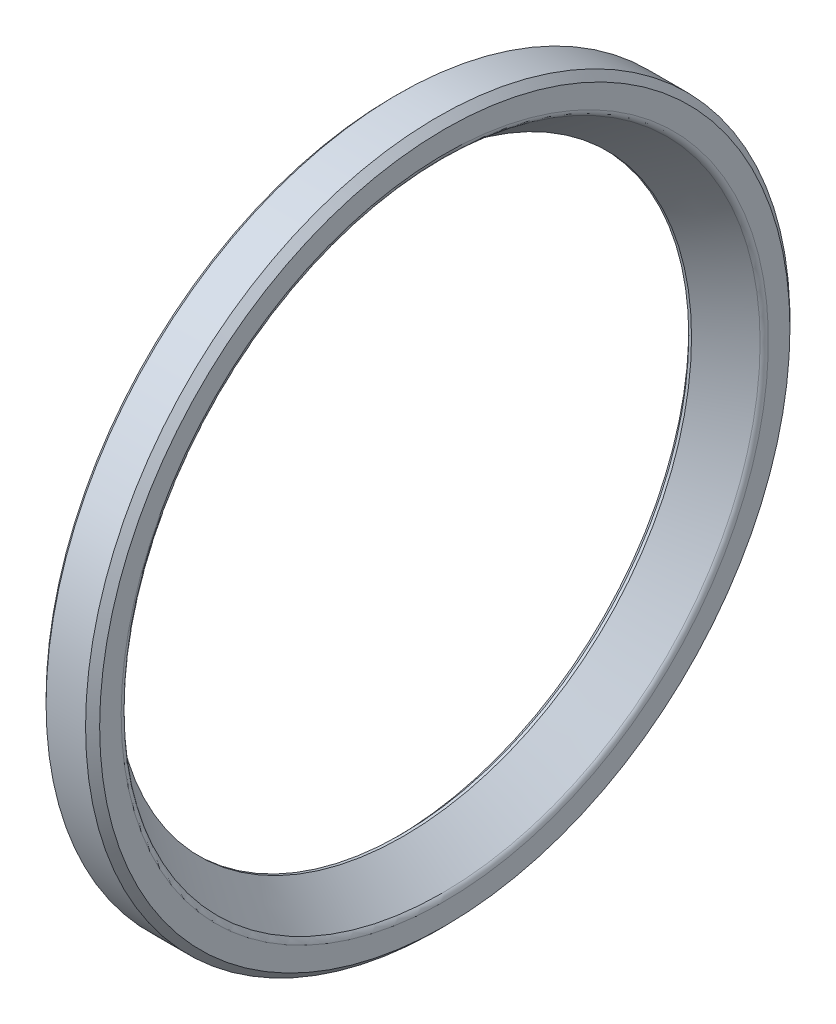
ISO-10303-21;
HEADER;
FILE_DESCRIPTION(('STEP AP214'),'2;1');
FILE_NAME('part.step','',(''),(''),'','','');
FILE_SCHEMA(('AUTOMOTIVE_DESIGN { 1 0 10303 214 1 1 1 1 }'));
ENDSEC;
DATA;
#1=APPLICATION_CONTEXT('core data for automotive mechanical design processes');
#2=APPLICATION_PROTOCOL_DEFINITION('international standard','automotive_design',2000,#1);
#3=PRODUCT_CONTEXT('',#1,'mechanical');
#4=PRODUCT('Part','Part','',(#3));
#5=PRODUCT_RELATED_PRODUCT_CATEGORY('part','',(#4));
#6=PRODUCT_DEFINITION_FORMATION('','',#4);
#7=PRODUCT_DEFINITION_CONTEXT('part definition',#1,'design');
#8=PRODUCT_DEFINITION('design','',#6,#7);
#9=PRODUCT_DEFINITION_SHAPE('','',#8);
#10=(LENGTH_UNIT() NAMED_UNIT(*) SI_UNIT(.MILLI.,.METRE.));
#11=(NAMED_UNIT(*) PLANE_ANGLE_UNIT() SI_UNIT($,.RADIAN.));
#12=(NAMED_UNIT(*) SI_UNIT($,.STERADIAN.) SOLID_ANGLE_UNIT());
#13=UNCERTAINTY_MEASURE_WITH_UNIT(LENGTH_MEASURE(1.E-05),#10,'distance_accuracy_value','');
#14=(GEOMETRIC_REPRESENTATION_CONTEXT(3) GLOBAL_UNCERTAINTY_ASSIGNED_CONTEXT((#13)) GLOBAL_UNIT_ASSIGNED_CONTEXT((#10,
#11,#12)) REPRESENTATION_CONTEXT('',''));
#15=CARTESIAN_POINT('',(0.,0.,0.));
#16=DIRECTION('',(0.,0.,1.));
#17=DIRECTION('',(1.,0.,0.));
#18=AXIS2_PLACEMENT_3D('',#15,#16,#17);
#19=CARTESIAN_POINT('',(0.73333333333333,0.,0.));
#20=DIRECTION('',(1.,0.,0.));
#21=DIRECTION('',(0.,0.,-1.));
#22=AXIS2_PLACEMENT_3D('',#19,#20,#21);
#23=CONICAL_SURFACE('',#22,55.,0.785398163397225);
#24=CARTESIAN_POINT('',(0.,0.,0.));
#25=DIRECTION('',(-1.,0.,0.));
#26=DIRECTION('',(0.,0.,1.));
#27=AXIS2_PLACEMENT_3D('',#24,#25,#26);
#28=CIRCLE('',#27,54.266666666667);
#29=CARTESIAN_POINT('',(0.,0.,54.266666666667));
#30=VERTEX_POINT('',#29);
#31=EDGE_CURVE('E87',#30,#30,#28,.T.);
#32=ORIENTED_EDGE('',*,*,#31,.F.);
#33=EDGE_LOOP('',(#32));
#34=FACE_BOUND('',#33,.T.);
#35=CARTESIAN_POINT('',(0.73333333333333,0.,0.));
#36=DIRECTION('',(-1.,0.,0.));
#37=DIRECTION('',(0.,0.,1.));
#38=AXIS2_PLACEMENT_3D('',#35,#36,#37);
#39=CIRCLE('',#38,55.);
#40=CARTESIAN_POINT('',(0.73333333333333,0.,55.));
#41=VERTEX_POINT('',#40);
#42=EDGE_CURVE('E10',#41,#41,#39,.T.);
#43=ORIENTED_EDGE('',*,*,#42,.T.);
#44=EDGE_LOOP('',(#43));
#45=FACE_BOUND('',#44,.T.);
#46=ADVANCED_FACE('F29',(#34,#45),#23,.T.);
#47=CARTESIAN_POINT('',(8.,0.,0.));
#48=DIRECTION('',(-1.,0.,0.));
#49=DIRECTION('',(0.,0.,1.));
#50=AXIS2_PLACEMENT_3D('',#47,#48,#49);
#51=CYLINDRICAL_SURFACE('',#50,55.);
#52=ORIENTED_EDGE('',*,*,#42,.F.);
#53=EDGE_LOOP('',(#52));
#54=FACE_BOUND('',#53,.T.);
#55=CARTESIAN_POINT('',(6.9,0.,0.));
#56=DIRECTION('',(-1.,0.,0.));
#57=DIRECTION('',(0.,0.,1.));
#58=AXIS2_PLACEMENT_3D('',#55,#56,#57);
#59=CIRCLE('',#58,55.);
#60=CARTESIAN_POINT('',(6.9,0.,55.));
#61=VERTEX_POINT('',#60);
#62=EDGE_CURVE('E35',#61,#61,#59,.T.);
#63=ORIENTED_EDGE('',*,*,#62,.T.);
#64=EDGE_LOOP('',(#63));
#65=FACE_BOUND('',#64,.T.);
#66=ADVANCED_FACE('F94',(#54,#65),#51,.T.);
#67=CARTESIAN_POINT('',(8.,0.,0.));
#68=DIRECTION('',(-1.,0.,0.));
#69=DIRECTION('',(0.,0.,1.));
#70=AXIS2_PLACEMENT_3D('',#67,#68,#69);
#71=CONICAL_SURFACE('',#70,53.9,0.785398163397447);
#72=ORIENTED_EDGE('',*,*,#62,.F.);
#73=EDGE_LOOP('',(#72));
#74=FACE_BOUND('',#73,.T.);
#75=CARTESIAN_POINT('',(8.,0.,0.));
#76=DIRECTION('',(-1.,0.,0.));
#77=DIRECTION('',(0.,0.,1.));
#78=AXIS2_PLACEMENT_3D('',#75,#76,#77);
#79=CIRCLE('',#78,53.9);
#80=CARTESIAN_POINT('',(8.,0.,53.9));
#81=VERTEX_POINT('',#80);
#82=EDGE_CURVE('E39',#81,#81,#79,.T.);
#83=ORIENTED_EDGE('',*,*,#82,.T.);
#84=EDGE_LOOP('',(#83));
#85=FACE_BOUND('',#84,.T.);
#86=ADVANCED_FACE('F98',(#74,#85),#71,.T.);
#87=CARTESIAN_POINT('',(8.,50.539943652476,0.));
#88=DIRECTION('',(-1.,0.,0.));
#89=DIRECTION('',(0.,0.,1.));
#90=AXIS2_PLACEMENT_3D('',#87,#88,#89);
#91=PLANE('',#90);
#92=ORIENTED_EDGE('',*,*,#82,.F.);
#93=EDGE_LOOP('',(#92));
#94=FACE_BOUND('',#93,.T.);
#95=CARTESIAN_POINT('',(8.,0.,0.));
#96=DIRECTION('',(-1.,0.,0.));
#97=DIRECTION('',(0.,0.,1.));
#98=AXIS2_PLACEMENT_3D('',#95,#96,#97);
#99=CIRCLE('',#98,50.539943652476);
#100=CARTESIAN_POINT('',(8.,0.,50.539943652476));
#101=VERTEX_POINT('',#100);
#102=EDGE_CURVE('E43',#101,#101,#99,.T.);
#103=ORIENTED_EDGE('',*,*,#102,.T.);
#104=EDGE_LOOP('',(#103));
#105=FACE_BOUND('',#104,.T.);
#106=ADVANCED_FACE('F103',(#94,#105),#91,.F.);
#107=CARTESIAN_POINT('',(6.90000000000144,0.,0.));
#108=DIRECTION('',(-1.,0.,0.));
#109=DIRECTION('',(0.,0.,1.));
#110=AXIS2_PLACEMENT_3D('',#107,#108,#109);
#111=TOROIDAL_SURFACE('',#110,50.5399436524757,1.09999999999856);
#112=ORIENTED_EDGE('',*,*,#102,.F.);
#113=EDGE_LOOP('',(#112));
#114=FACE_BOUND('',#113,.T.);
#115=CARTESIAN_POINT('',(7.5728475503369,0.,0.));
#116=DIRECTION('',(-1.,0.,0.));
#117=DIRECTION('',(0.,0.,1.));
#118=AXIS2_PLACEMENT_3D('',#115,#116,#117);
#119=CIRCLE('',#118,49.669727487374);
#120=CARTESIAN_POINT('',(7.5728475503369,0.,49.669727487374));
#121=VERTEX_POINT('',#120);
#122=EDGE_CURVE('E48',#121,#121,#119,.T.);
#123=ORIENTED_EDGE('',*,*,#122,.T.);
#124=EDGE_LOOP('',(#123));
#125=FACE_BOUND('',#124,.T.);
#126=ADVANCED_FACE('F109',(#114,#125),#111,.T.);
#127=CARTESIAN_POINT('',(1.5333333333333,0.,0.));
#128=DIRECTION('',(1.,0.,0.));
#129=DIRECTION('',(0.,0.,-1.));
#130=AXIS2_PLACEMENT_3D('',#127,#128,#129);
#131=CONICAL_SURFACE('',#130,45.,0.658181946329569);
#132=ORIENTED_EDGE('',*,*,#122,.F.);
#133=EDGE_LOOP('',(#132));
#134=FACE_BOUND('',#133,.T.);
#135=CARTESIAN_POINT('',(1.5333333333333,0.,0.));
#136=DIRECTION('',(-1.,0.,0.));
#137=DIRECTION('',(0.,0.,1.));
#138=AXIS2_PLACEMENT_3D('',#135,#136,#137);
#139=CIRCLE('',#138,45.);
#140=CARTESIAN_POINT('',(1.5333333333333,0.,45.));
#141=VERTEX_POINT('',#140);
#142=EDGE_CURVE('E51',#141,#141,#139,.T.);
#143=ORIENTED_EDGE('',*,*,#142,.T.);
#144=EDGE_LOOP('',(#143));
#145=FACE_BOUND('',#144,.T.);
#146=ADVANCED_FACE('F113',(#134,#145),#131,.F.);
#147=CARTESIAN_POINT('',(8.,0.,0.));
#148=DIRECTION('',(-1.,0.,0.));
#149=DIRECTION('',(0.,0.,1.));
#150=AXIS2_PLACEMENT_3D('',#147,#148,#149);
#151=CYLINDRICAL_SURFACE('',#150,45.);
#152=ORIENTED_EDGE('',*,*,#142,.F.);
#153=EDGE_LOOP('',(#152));
#154=FACE_BOUND('',#153,.T.);
#155=CARTESIAN_POINT('',(1.1,0.,0.));
#156=DIRECTION('',(-1.,0.,0.));
#157=DIRECTION('',(0.,0.,1.));
#158=AXIS2_PLACEMENT_3D('',#155,#156,#157);
#159=CIRCLE('',#158,45.);
#160=CARTESIAN_POINT('',(1.1,0.,45.));
#161=VERTEX_POINT('',#160);
#162=EDGE_CURVE('E54',#161,#161,#159,.T.);
#163=ORIENTED_EDGE('',*,*,#162,.T.);
#164=EDGE_LOOP('',(#163));
#165=FACE_BOUND('',#164,.T.);
#166=ADVANCED_FACE('F117',(#154,#165),#151,.F.);
#167=CARTESIAN_POINT('',(0.2,0.,0.));
#168=DIRECTION('',(-1.,0.,0.));
#169=DIRECTION('',(0.,0.,1.));
#170=AXIS2_PLACEMENT_3D('',#167,#168,#169);
#171=CONICAL_SURFACE('',#170,45.9,0.785398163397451);
#172=ORIENTED_EDGE('',*,*,#162,.F.);
#173=EDGE_LOOP('',(#172));
#174=FACE_BOUND('',#173,.T.);
#175=CARTESIAN_POINT('',(0.2,0.,0.));
#176=DIRECTION('',(-1.,0.,0.));
#177=DIRECTION('',(0.,0.,1.));
#178=AXIS2_PLACEMENT_3D('',#175,#176,#177);
#179=CIRCLE('',#178,45.9);
#180=CARTESIAN_POINT('',(0.2,0.,45.9));
#181=VERTEX_POINT('',#180);
#182=EDGE_CURVE('E57',#181,#181,#179,.T.);
#183=ORIENTED_EDGE('',*,*,#182,.T.);
#184=EDGE_LOOP('',(#183));
#185=FACE_BOUND('',#184,.T.);
#186=ADVANCED_FACE('F121',(#174,#185),#171,.F.);
#187=CARTESIAN_POINT('',(0.19999999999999,47.5000000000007,0.));
#188=DIRECTION('',(1.,0.,0.));
#189=DIRECTION('',(0.,0.,-1.));
#190=AXIS2_PLACEMENT_3D('',#187,#188,#189);
#191=PLANE('',#190);
#192=ORIENTED_EDGE('',*,*,#182,.F.);
#193=EDGE_LOOP('',(#192));
#194=FACE_BOUND('',#193,.T.);
#195=CARTESIAN_POINT('',(0.199999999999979,0.,0.));
#196=DIRECTION('',(-1.,0.,0.));
#197=DIRECTION('',(0.,0.,1.));
#198=AXIS2_PLACEMENT_3D('',#195,#196,#197);
#199=CIRCLE('',#198,47.5000000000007);
#200=CARTESIAN_POINT('',(0.199999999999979,0.,47.5000000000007));
#201=VERTEX_POINT('',#200);
#202=EDGE_CURVE('E60',#201,#201,#199,.T.);
#203=ORIENTED_EDGE('',*,*,#202,.T.);
#204=EDGE_LOOP('',(#203));
#205=FACE_BOUND('',#204,.T.);
#206=ADVANCED_FACE('F125',(#194,#205),#191,.F.);
#207=CARTESIAN_POINT('',(8.,0.,0.));
#208=DIRECTION('',(-1.,0.,0.));
#209=DIRECTION('',(0.,0.,1.));
#210=AXIS2_PLACEMENT_3D('',#207,#208,#209);
#211=CYLINDRICAL_SURFACE('',#210,47.5000000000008);
#212=ORIENTED_EDGE('',*,*,#202,.F.);
#213=EDGE_LOOP('',(#212));
#214=FACE_BOUND('',#213,.T.);
#215=CARTESIAN_POINT('',(0.974316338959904,0.,0.));
#216=DIRECTION('',(-1.,0.,0.));
#217=DIRECTION('',(0.,0.,1.));
#218=AXIS2_PLACEMENT_3D('',#215,#216,#217);
#219=CIRCLE('',#218,47.5000000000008);
#220=CARTESIAN_POINT('',(0.974316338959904,0.,47.5000000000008));
#221=VERTEX_POINT('',#220);
#222=EDGE_CURVE('E63',#221,#221,#219,.T.);
#223=ORIENTED_EDGE('',*,*,#222,.T.);
#224=EDGE_LOOP('',(#223));
#225=FACE_BOUND('',#224,.T.);
#226=ADVANCED_FACE('F129',(#214,#225),#211,.T.);
#227=CARTESIAN_POINT('',(1.53333333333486,0.,0.));
#228=DIRECTION('',(-1.,0.,0.));
#229=DIRECTION('',(0.,0.,1.));
#230=AXIS2_PLACEMENT_3D('',#227,#228,#229);
#231=TOROIDAL_SURFACE('',#230,47.0000000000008,0.75000000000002);
#232=ORIENTED_EDGE('',*,*,#222,.F.);
#233=EDGE_LOOP('',(#232));
#234=FACE_BOUND('',#233,.T.);
#235=CARTESIAN_POINT('',(2.09235032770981,0.,0.));
#236=DIRECTION('',(-1.,0.,0.));
#237=DIRECTION('',(0.,0.,1.));
#238=AXIS2_PLACEMENT_3D('',#235,#236,#237);
#239=CIRCLE('',#238,47.5000000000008);
#240=CARTESIAN_POINT('',(2.09235032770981,0.,47.5000000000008));
#241=VERTEX_POINT('',#240);
#242=EDGE_CURVE('E66',#241,#241,#239,.T.);
#243=ORIENTED_EDGE('',*,*,#242,.T.);
#244=EDGE_LOOP('',(#243));
#245=FACE_BOUND('',#244,.T.);
#246=ADVANCED_FACE('F133',(#234,#245),#231,.T.);
#247=CARTESIAN_POINT('',(5.55803979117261,0.,0.));
#248=DIRECTION('',(1.,0.,0.));
#249=DIRECTION('',(0.,0.,-1.));
#250=AXIS2_PLACEMENT_3D('',#247,#248,#249);
#251=CONICAL_SURFACE('',#250,49.9700937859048,0.619217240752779);
#252=ORIENTED_EDGE('',*,*,#242,.F.);
#253=EDGE_LOOP('',(#252));
#254=FACE_BOUND('',#253,.T.);
#255=CARTESIAN_POINT('',(5.55803979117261,0.,0.));
#256=DIRECTION('',(-1.,0.,0.));
#257=DIRECTION('',(0.,0.,1.));
#258=AXIS2_PLACEMENT_3D('',#255,#256,#257);
#259=CIRCLE('',#258,49.9700937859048);
#260=CARTESIAN_POINT('',(5.55803979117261,0.,49.9700937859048));
#261=VERTEX_POINT('',#260);
#262=EDGE_CURVE('E69',#261,#261,#259,.T.);
#263=ORIENTED_EDGE('',*,*,#262,.T.);
#264=EDGE_LOOP('',(#263));
#265=FACE_BOUND('',#264,.T.);
#266=ADVANCED_FACE('F137',(#254,#265),#251,.T.);
#267=CARTESIAN_POINT('',(5.49999999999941,0.,0.));
#268=DIRECTION('',(-1.,0.,0.));
#269=DIRECTION('',(0.,0.,1.));
#270=AXIS2_PLACEMENT_3D('',#267,#268,#269);
#271=TOROIDAL_SURFACE('',#270,50.0515270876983,0.1000000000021);
#272=ORIENTED_EDGE('',*,*,#262,.F.);
#273=EDGE_LOOP('',(#272));
#274=FACE_BOUND('',#273,.T.);
#275=CARTESIAN_POINT('',(5.60000000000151,0.,0.));
#276=DIRECTION('',(-1.,0.,0.));
#277=DIRECTION('',(0.,0.,1.));
#278=AXIS2_PLACEMENT_3D('',#275,#276,#277);
#279=CIRCLE('',#278,50.0515270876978);
#280=CARTESIAN_POINT('',(5.60000000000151,0.,50.0515270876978));
#281=VERTEX_POINT('',#280);
#282=EDGE_CURVE('E72',#281,#281,#279,.T.);
#283=ORIENTED_EDGE('',*,*,#282,.T.);
#284=EDGE_LOOP('',(#283));
#285=FACE_BOUND('',#284,.T.);
#286=ADVANCED_FACE('F141',(#274,#285),#271,.F.);
#287=CARTESIAN_POINT('',(5.60000000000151,52.0727272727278,0.));
#288=DIRECTION('',(1.,0.,0.));
#289=DIRECTION('',(0.,0.,-1.));
#290=AXIS2_PLACEMENT_3D('',#287,#288,#289);
#291=PLANE('',#290);
#292=ORIENTED_EDGE('',*,*,#282,.F.);
#293=EDGE_LOOP('',(#292));
#294=FACE_BOUND('',#293,.T.);
#295=CARTESIAN_POINT('',(5.60000000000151,0.,0.));
#296=DIRECTION('',(-1.,0.,0.));
#297=DIRECTION('',(0.,0.,1.));
#298=AXIS2_PLACEMENT_3D('',#295,#296,#297);
#299=CIRCLE('',#298,52.0727272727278);
#300=CARTESIAN_POINT('',(5.60000000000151,0.,52.0727272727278));
#301=VERTEX_POINT('',#300);
#302=EDGE_CURVE('E75',#301,#301,#299,.T.);
#303=ORIENTED_EDGE('',*,*,#302,.T.);
#304=EDGE_LOOP('',(#303));
#305=FACE_BOUND('',#304,.T.);
#306=ADVANCED_FACE('F145',(#294,#305),#291,.F.);
#307=CARTESIAN_POINT('',(5.40000000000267,0.,0.));
#308=DIRECTION('',(-1.,0.,0.));
#309=DIRECTION('',(0.,0.,1.));
#310=AXIS2_PLACEMENT_3D('',#307,#308,#309);
#311=TOROIDAL_SURFACE('',#310,52.0727272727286,0.199999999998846);
#312=ORIENTED_EDGE('',*,*,#302,.F.);
#313=EDGE_LOOP('',(#312));
#314=FACE_BOUND('',#313,.T.);
#315=CARTESIAN_POINT('',(5.40000000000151,0.,0.));
#316=DIRECTION('',(-1.,0.,0.));
#317=DIRECTION('',(0.,0.,1.));
#318=AXIS2_PLACEMENT_3D('',#315,#316,#317);
#319=CIRCLE('',#318,52.2727272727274);
#320=CARTESIAN_POINT('',(5.40000000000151,0.,52.2727272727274));
#321=VERTEX_POINT('',#320);
#322=EDGE_CURVE('E78',#321,#321,#319,.T.);
#323=ORIENTED_EDGE('',*,*,#322,.T.);
#324=EDGE_LOOP('',(#323));
#325=FACE_BOUND('',#324,.T.);
#326=ADVANCED_FACE('F149',(#314,#325),#311,.F.);
#327=CARTESIAN_POINT('',(8.,0.,0.));
#328=DIRECTION('',(-1.,0.,0.));
#329=DIRECTION('',(0.,0.,1.));
#330=AXIS2_PLACEMENT_3D('',#327,#328,#329);
#331=CYLINDRICAL_SURFACE('',#330,52.2727272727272);
#332=ORIENTED_EDGE('',*,*,#322,.F.);
#333=EDGE_LOOP('',(#332));
#334=FACE_BOUND('',#333,.T.);
#335=CARTESIAN_POINT('',(0.73333333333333,0.,0.));
#336=DIRECTION('',(-1.,0.,0.));
#337=DIRECTION('',(0.,0.,1.));
#338=AXIS2_PLACEMENT_3D('',#335,#336,#337);
#339=CIRCLE('',#338,52.272727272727);
#340=CARTESIAN_POINT('',(0.73333333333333,0.,52.272727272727));
#341=VERTEX_POINT('',#340);
#342=EDGE_CURVE('E81',#341,#341,#339,.T.);
#343=ORIENTED_EDGE('',*,*,#342,.T.);
#344=EDGE_LOOP('',(#343));
#345=FACE_BOUND('',#344,.T.);
#346=ADVANCED_FACE('F153',(#334,#345),#331,.F.);
#347=CARTESIAN_POINT('',(0.,0.,0.));
#348=DIRECTION('',(-1.,0.,0.));
#349=DIRECTION('',(0.,0.,1.));
#350=AXIS2_PLACEMENT_3D('',#347,#348,#349);
#351=CONICAL_SURFACE('',#350,53.006060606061,0.785398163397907);
#352=ORIENTED_EDGE('',*,*,#342,.F.);
#353=EDGE_LOOP('',(#352));
#354=FACE_BOUND('',#353,.T.);
#355=CARTESIAN_POINT('',(0.,0.,0.));
#356=DIRECTION('',(-1.,0.,0.));
#357=DIRECTION('',(0.,0.,1.));
#358=AXIS2_PLACEMENT_3D('',#355,#356,#357);
#359=CIRCLE('',#358,53.006060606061);
#360=CARTESIAN_POINT('',(0.,0.,53.006060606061));
#361=VERTEX_POINT('',#360);
#362=EDGE_CURVE('E84',#361,#361,#359,.T.);
#363=ORIENTED_EDGE('',*,*,#362,.T.);
#364=EDGE_LOOP('',(#363));
#365=FACE_BOUND('',#364,.T.);
#366=ADVANCED_FACE('F157',(#354,#365),#351,.F.);
#367=CARTESIAN_POINT('',(0.,54.266666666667,0.));
#368=DIRECTION('',(1.,0.,0.));
#369=DIRECTION('',(0.,0.,-1.));
#370=AXIS2_PLACEMENT_3D('',#367,#368,#369);
#371=PLANE('',#370);
#372=ORIENTED_EDGE('',*,*,#362,.F.);
#373=EDGE_LOOP('',(#372));
#374=FACE_BOUND('',#373,.T.);
#375=ORIENTED_EDGE('',*,*,#31,.T.);
#376=EDGE_LOOP('',(#375));
#377=FACE_BOUND('',#376,.T.);
#378=ADVANCED_FACE('F91',(#374,#377),#371,.F.);
#379=CLOSED_SHELL('',(#46,#66,#86,#106,#126,#146,#166,#186,#206,#226,#246,#266,#286,#306,#326,
#346,#366,#378));
#380=MANIFOLD_SOLID_BREP('B2',#379);
#381=ADVANCED_BREP_SHAPE_REPRESENTATION('',(#18,#380),#14);
#382=SHAPE_DEFINITION_REPRESENTATION(#9,#381);
ENDSEC;
END-ISO-10303-21;
